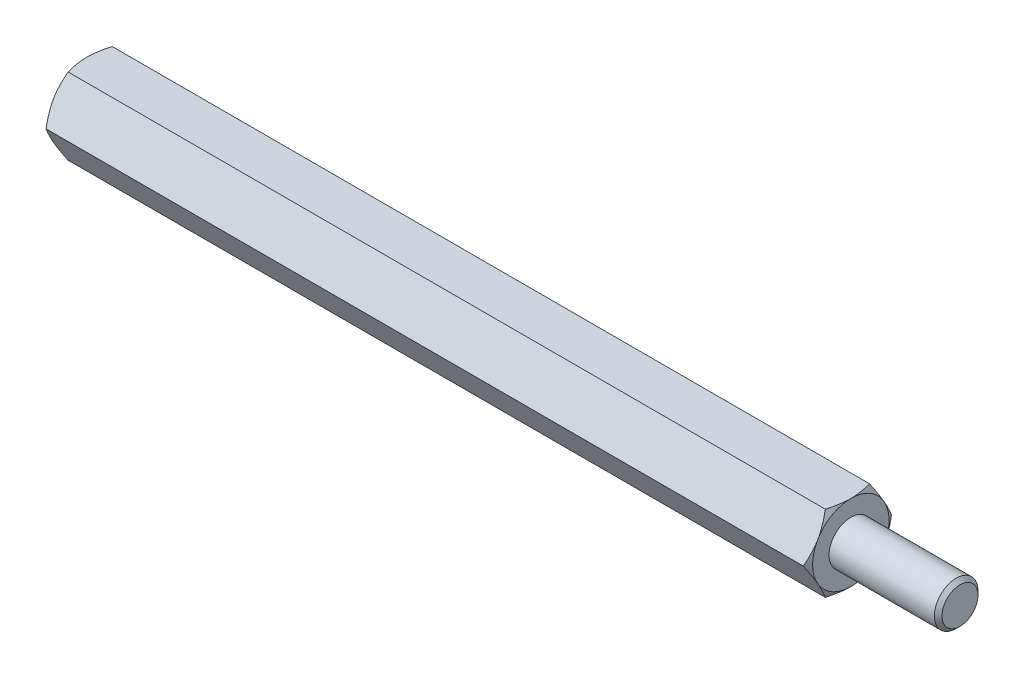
from build123d import *

# Parameters (mm, degrees)
EXTRUDE2_DEPTH = 35
SKETCH3_R      = 1.65
EXTRUDE3_DEPTH = 10
SKETCH5_R      = 2
EXTRUDE4_DEPTH = 10
CHAMFER1_SIZE  = 0.35


with BuildPart() as part:
    # Sketch1 → Extrude2 (new, symmetric)
    with BuildSketch(Plane(origin=(0, 0, 0), x_dir=(0, 0, -1), z_dir=(1, 0, 0))):
        Polygon((2.020725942, 3.5), (-2.020725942, 3.5), (-4.041451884, 0), (-2.020725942, -3.5), (2.020725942, -3.5), (4.041451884, 0), align=None)
    extrude(amount=EXTRUDE2_DEPTH, both=True)

    # Sketch2 → Cut-Revolve1 (revolve, cut)
    with BuildSketch(Plane.XY):
        with BuildLine():
            Line((-35, 3.5), (-33.5, 6.098076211))
            ThreePointArc((-33.5, 6.098076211), (-33.98810136, 7.276457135), (-35, 6.5))
            Line((-35, 6.5), (-35, 3.5))
        make_face()
    cut_revolve1 = revolve(axis=Axis((0, 0, 0), (1, 0, 0)), mode=Mode.SUBTRACT)

    # Mirror1: Cut-Revolve1 across plane
    add(cut_revolve1.mirror(Plane(origin=(0, 0, 0), x_dir=(0, 0, 1), z_dir=(1, 0, 0))), mode=Mode.SUBTRACT)

    # Sketch3 → Extrude3 (cut)
    with BuildSketch(Plane.ZY.offset(35)):
        Circle(SKETCH3_R)
    extrude(amount=-EXTRUDE3_DEPTH, mode=Mode.SUBTRACT)

    # Sketch4 → Cut-Revolve2 (revolve, cut)
    with BuildSketch(Plane.XY, mode=Mode.PRIVATE) as cut_revolve2_sk:
        Polygon((-25, 0), (-25, 1.65), (-24.047372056, 0), align=None)
    revolve(cut_revolve2_sk.sketch.rotate(Axis((-24.047372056, 0, 0), (-1, 0, 0)), 270), axis=Axis((-24.047372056, 0, 0), (-1, 0, 0)), mode=Mode.SUBTRACT)

    # Sketch5 → Extrude4 (add)
    with BuildSketch(Plane(origin=(35, 0, 0), x_dir=(0, 0, -1), z_dir=(1, 0, 0))):
        Circle(SKETCH5_R)
    extrude(amount=EXTRUDE4_DEPTH)

    # Chamfer1
    chamfer1_edges = [part.edges().sort_by_distance(p)[0] for p in [
        (45, 0, 2),
    ]]
    chamfer(chamfer1_edges, length=CHAMFER1_SIZE)


solid = part.part
